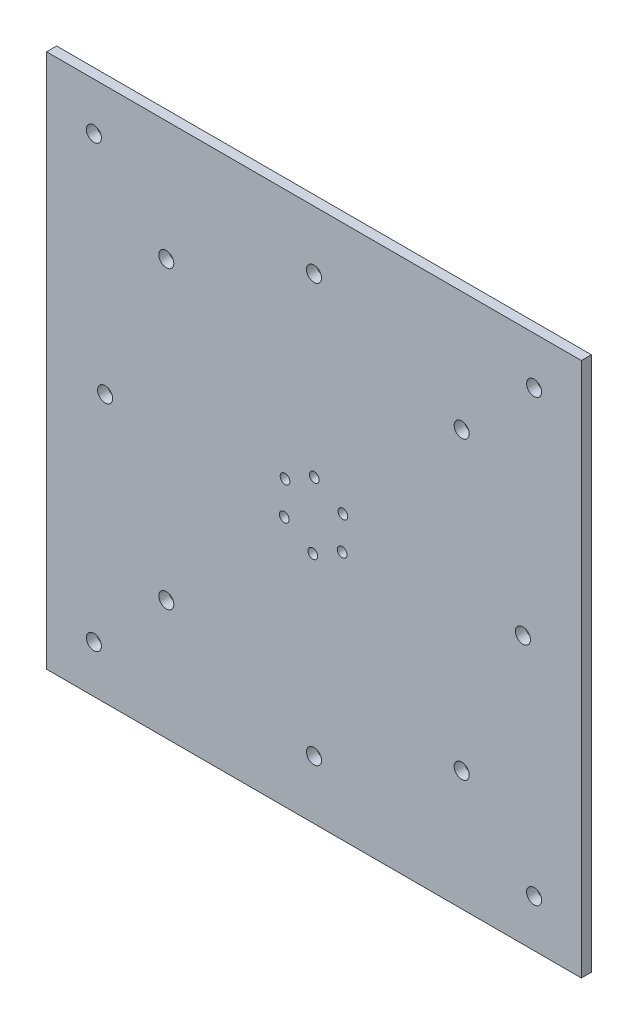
from build123d import *

# Parameters (mm, degrees)
ESQUISSE1_R          = 80
BOSS_EXTRU_1_DEPTH   = 3
D_GAGEMENT_M2_51_D   = 2.9
M4_CLEARANCE_HOLE1_D = 4.5


with BuildPart() as part:
    # Esquisse1 → Boss.-Extru.1 (new body)
    with BuildSketch(Plane.XY):
        Circle(ESQUISSE1_R)
        with BuildLine():
            ThreePointArc((3.2e-07, 80), (56.568542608, 56.568542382), (80, 0))
            Line((80, 0), (80, 80))
            Line((80, 80), (3.2e-07, 80))
        make_face()
        with BuildLine():
            Line((-80, 80), (-80, -1.98e-07))
            ThreePointArc((-80, -1.98e-07), (-56.568542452, 56.568542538), (3.2e-07, 80))
            Line((3.2e-07, 80), (-80, 80))
        make_face()
        with BuildLine():
            Line((-80, -80), (0, -80))
            ThreePointArc((0, -80), (-56.568542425, -56.568542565), (-80, -1.98e-07))
            Line((-80, -1.98e-07), (-80, -80))
        make_face()
        with BuildLine():
            Line((0, -80), (80, -80))
            Line((80, -80), (80, 0))
            ThreePointArc((80, 0), (56.568542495, -56.568542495), (0, -80))
        make_face()
    extrude(amount=BOSS_EXTRU_1_DEPTH)

    # D_gagement M2.51 (through all)
    with Locations(Plane(origin=(0, 0, 0), x_dir=(-1, 0, 0), z_dir=(0, 0, -1))):
        with Locations((-0.113783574, 9.797526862), (8.660254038, 5), (8.892492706, -4.997302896), (0.350693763, -10.197078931), (-8.423343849, -5.39955207), (-8.655582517, 4.597750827)):
            Hole(D_GAGEMENT_M2_51_D / 2)

    # M4 Clearance Hole1 (through all)
    with Locations(Plane(origin=(0, 0, 0), x_dir=(-1, 0, 0), z_dir=(0, 0, -1))):
        with Locations((0, 62.5), (44.194173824, 44.194173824), (62.5, 0), (44.194173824, -44.194173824), (0, -62.5), (-44.194173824, -44.194173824), (-62.5, 0), (-44.194173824, 44.194173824), (-65.857864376, 65.857864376), (65.857864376, 65.857864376), (65.857864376, -65.857864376), (-65.857864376, -65.857864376)):
            Hole(M4_CLEARANCE_HOLE1_D / 2)


solid = part.part
